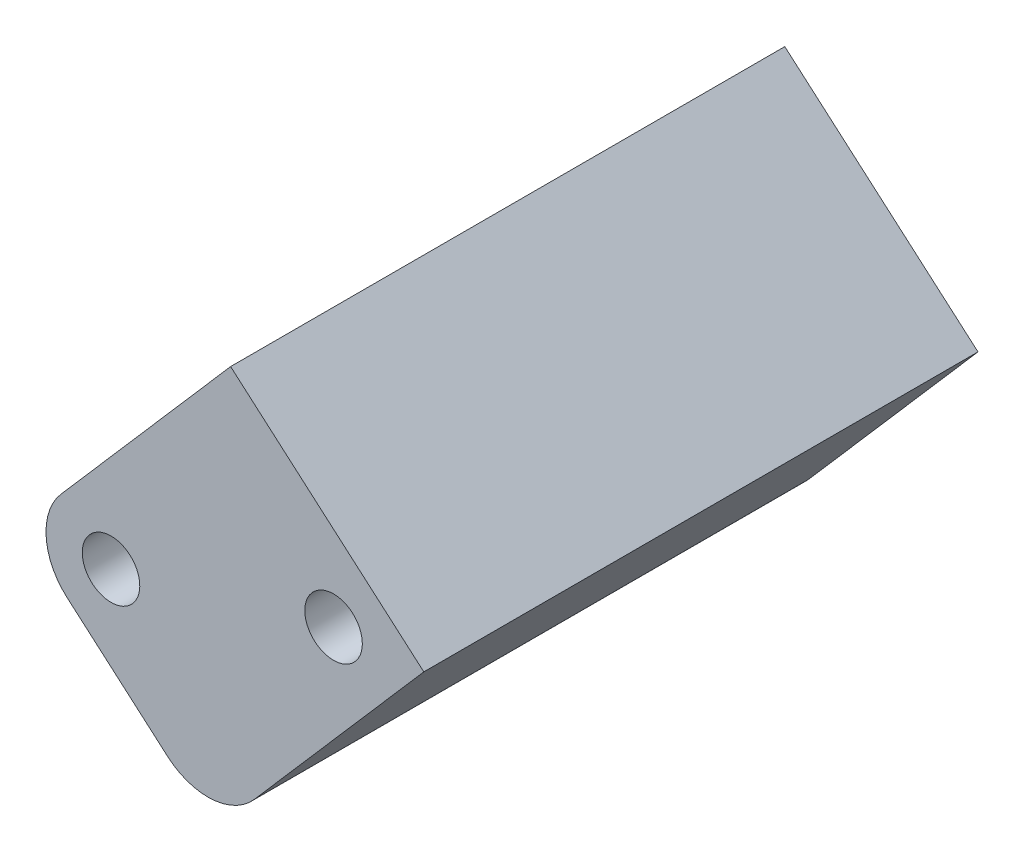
ISO-10303-21;
HEADER;
FILE_DESCRIPTION(('STEP AP214'),'2;1');
FILE_NAME('part.step','',(''),(''),'','','');
FILE_SCHEMA(('AUTOMOTIVE_DESIGN { 1 0 10303 214 1 1 1 1 }'));
ENDSEC;
DATA;
#1=APPLICATION_CONTEXT('core data for automotive mechanical design processes');
#2=APPLICATION_PROTOCOL_DEFINITION('international standard','automotive_design',2000,#1);
#3=PRODUCT_CONTEXT('',#1,'mechanical');
#4=PRODUCT('Part','Part','',(#3));
#5=PRODUCT_RELATED_PRODUCT_CATEGORY('part','',(#4));
#6=PRODUCT_DEFINITION_FORMATION('','',#4);
#7=PRODUCT_DEFINITION_CONTEXT('part definition',#1,'design');
#8=PRODUCT_DEFINITION('design','',#6,#7);
#9=PRODUCT_DEFINITION_SHAPE('','',#8);
#10=(LENGTH_UNIT() NAMED_UNIT(*) SI_UNIT(.MILLI.,.METRE.));
#11=(NAMED_UNIT(*) PLANE_ANGLE_UNIT() SI_UNIT($,.RADIAN.));
#12=(NAMED_UNIT(*) SI_UNIT($,.STERADIAN.) SOLID_ANGLE_UNIT());
#13=UNCERTAINTY_MEASURE_WITH_UNIT(LENGTH_MEASURE(1.E-05),#10,'distance_accuracy_value','');
#14=(GEOMETRIC_REPRESENTATION_CONTEXT(3) GLOBAL_UNCERTAINTY_ASSIGNED_CONTEXT((#13)) GLOBAL_UNIT_ASSIGNED_CONTEXT((#10,
#11,#12)) REPRESENTATION_CONTEXT('',''));
#15=CARTESIAN_POINT('',(0.,0.,0.));
#16=DIRECTION('',(0.,0.,1.));
#17=DIRECTION('',(1.,0.,0.));
#18=AXIS2_PLACEMENT_3D('',#15,#16,#17);
#19=CARTESIAN_POINT('',(-5.06261699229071E-11,1.64313007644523E-11,3.19935692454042));
#20=DIRECTION('',(-1.58417609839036E-11,5.13786431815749E-12,1.));
#21=DIRECTION('',(1.,0.,1.58417609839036E-11));
#22=AXIS2_PLACEMENT_3D('',#19,#20,#21);
#23=PLANE('',#22);
#24=CARTESIAN_POINT('',(-672.686911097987,-85.6457752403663,3.19935691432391));
#25=DIRECTION('',(0.,-5.13786431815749E-12,-1.));
#26=DIRECTION('',(0.,1.,-5.13786431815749E-12));
#27=AXIS2_PLACEMENT_3D('',#24,#25,#26);
#28=CIRCLE('',#27,5.35940000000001);
#29=CARTESIAN_POINT('',(-672.686911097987,-80.2863752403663,3.19935691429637));
#30=VERTEX_POINT('',#29);
#31=EDGE_CURVE('E319',#30,#30,#28,.T.);
#32=ORIENTED_EDGE('',*,*,#31,.F.);
#33=EDGE_LOOP('',(#32));
#34=FACE_BOUND('',#33,.T.);
#35=CARTESIAN_POINT('',(-700.297503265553,-93.2283633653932,3.19935691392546));
#36=DIRECTION('',(0.,-5.13786431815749E-12,-1.));
#37=DIRECTION('',(0.,1.,-5.13786431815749E-12));
#38=AXIS2_PLACEMENT_3D('',#35,#36,#37);
#39=CIRCLE('',#38,5.35940000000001);
#40=CARTESIAN_POINT('',(-700.297503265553,-87.8689633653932,3.19935691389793));
#41=VERTEX_POINT('',#40);
#42=EDGE_CURVE('E303',#41,#41,#39,.T.);
#43=ORIENTED_EDGE('',*,*,#42,.F.);
#44=EDGE_LOOP('',(#43));
#45=FACE_BOUND('',#44,.T.);
#46=DIRECTION('',(-0.655690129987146,-0.755030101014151,-6.50804410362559E-12));
#47=VECTOR('',#46,1.);
#48=CARTESIAN_POINT('',(-706.498736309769,-88.263545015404,3.19935691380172));
#49=LINE('',#48,#47);
#50=CARTESIAN_POINT('',(-685.461524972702,-64.0391025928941,3.19935691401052));
#51=VERTEX_POINT('',#50);
#52=CARTESIAN_POINT('',(-706.498736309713,-88.2635450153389,3.19935691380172));
#53=VERTEX_POINT('',#52);
#54=EDGE_CURVE('E220',#51,#53,#49,.T.);
#55=ORIENTED_EDGE('',*,*,#54,.F.);
#56=DIRECTION('',(-0.755030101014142,0.655690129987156,-1.53298533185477E-11));
#57=VECTOR('',#56,1.);
#58=CARTESIAN_POINT('',(-685.461524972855,-64.0391025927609,3.19935691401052));
#59=LINE('',#58,#57);
#60=CARTESIAN_POINT('',(-661.489319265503,-84.857264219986,3.19935691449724));
#61=VERTEX_POINT('',#60);
#62=EDGE_CURVE('E227',#61,#51,#59,.T.);
#63=ORIENTED_EDGE('',*,*,#62,.F.);
#64=DIRECTION('',(0.655690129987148,0.75503010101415,6.50804410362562E-12));
#65=VECTOR('',#64,1.);
#66=CARTESIAN_POINT('',(-661.48931926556,-84.8572642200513,3.19935691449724));
#67=LINE('',#66,#65);
#68=CARTESIAN_POINT('',(-682.526530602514,-109.081706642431,3.19935691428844));
#69=VERTEX_POINT('',#68);
#70=EDGE_CURVE('E293',#69,#61,#67,.T.);
#71=ORIENTED_EDGE('',*,*,#70,.F.);
#72=CARTESIAN_POINT('',(-688.279859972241,-104.085347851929,3.19935691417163));
#73=DIRECTION('',(-1.58417609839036E-11,5.13786431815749E-12,1.));
#74=DIRECTION('',(1.,0.,1.58417609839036E-11));
#75=AXIS2_PLACEMENT_3D('',#72,#73,#74);
#76=CIRCLE('',#75,7.61999999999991);
#77=CARTESIAN_POINT('',(-693.276218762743,-109.838677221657,3.19935691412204));
#78=VERTEX_POINT('',#77);
#79=EDGE_CURVE('E289',#78,#69,#76,.T.);
#80=ORIENTED_EDGE('',*,*,#79,.F.);
#81=DIRECTION('',(0.755030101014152,-0.655690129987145,1.53298533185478E-11));
#82=VECTOR('',#81,1.);
#83=CARTESIAN_POINT('',(-693.276218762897,-109.838677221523,3.19935691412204));
#84=LINE('',#83,#82);
#85=CARTESIAN_POINT('',(-705.741765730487,-99.0132331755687,3.19935691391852));
#86=VERTEX_POINT('',#85);
#87=EDGE_CURVE('E184',#86,#78,#84,.T.);
#88=ORIENTED_EDGE('',*,*,#87,.F.);
#89=CARTESIAN_POINT('',(-700.745406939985,-93.2599038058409,3.19935691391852));
#90=DIRECTION('',(-1.58417609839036E-11,5.13786431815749E-12,1.));
#91=DIRECTION('',(1.,0.,1.58417609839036E-11));
#92=AXIS2_PLACEMENT_3D('',#89,#90,#91);
#93=CIRCLE('',#92,7.61999999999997);
#94=EDGE_CURVE('E60',#53,#86,#93,.T.);
#95=ORIENTED_EDGE('',*,*,#94,.F.);
#96=EDGE_LOOP('',(#55,#63,#71,#80,#88,#95));
#97=FACE_BOUND('',#96,.T.);
#98=ADVANCED_FACE('F168',(#34,#45,#97),#23,.F.);
#99=CARTESIAN_POINT('',(-706.498736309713,-88.2635450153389,-10.033));
#100=DIRECTION('',(0.755030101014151,-0.655690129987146,0.));
#101=DIRECTION('',(0.655690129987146,0.755030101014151,0.));
#102=AXIS2_PLACEMENT_3D('',#99,#100,#101);
#103=PLANE('',#102);
#104=DIRECTION('',(0.,0.,1.));
#105=VECTOR('',#104,1.);
#106=CARTESIAN_POINT('',(-685.461524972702,-64.039102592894,-10.033));
#107=LINE('',#106,#105);
#108=CARTESIAN_POINT('',(-685.461524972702,-64.039102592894,71.9582));
#109=VERTEX_POINT('',#108);
#110=EDGE_CURVE('E177',#51,#109,#107,.T.);
#111=ORIENTED_EDGE('',*,*,#110,.F.);
#112=ORIENTED_EDGE('',*,*,#54,.T.);
#113=DIRECTION('',(0.,0.,1.));
#114=VECTOR('',#113,1.);
#115=CARTESIAN_POINT('',(-706.498736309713,-88.2635450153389,-10.033));
#116=LINE('',#115,#114);
#117=CARTESIAN_POINT('',(-706.498736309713,-88.2635450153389,71.9582));
#118=VERTEX_POINT('',#117);
#119=EDGE_CURVE('E191',#53,#118,#116,.T.);
#120=ORIENTED_EDGE('',*,*,#119,.T.);
#121=DIRECTION('',(0.655690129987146,0.755030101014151,0.));
#122=VECTOR('',#121,1.);
#123=CARTESIAN_POINT('',(-706.498736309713,-88.2635450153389,71.9582));
#124=LINE('',#123,#122);
#125=EDGE_CURVE('E226',#118,#109,#124,.T.);
#126=ORIENTED_EDGE('',*,*,#125,.T.);
#127=EDGE_LOOP('',(#111,#112,#120,#126));
#128=FACE_BOUND('',#127,.T.);
#129=ADVANCED_FACE('F170',(#128),#103,.F.);
#130=CARTESIAN_POINT('',(-685.461524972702,-64.039102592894,-10.033));
#131=DIRECTION('',(-0.655690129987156,-0.755030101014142,0.));
#132=DIRECTION('',(0.755030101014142,-0.655690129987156,0.));
#133=AXIS2_PLACEMENT_3D('',#130,#131,#132);
#134=PLANE('',#133);
#135=DIRECTION('',(0.,0.,1.));
#136=VECTOR('',#135,1.);
#137=CARTESIAN_POINT('',(-661.489319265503,-84.857264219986,-10.033));
#138=LINE('',#137,#136);
#139=CARTESIAN_POINT('',(-661.489319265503,-84.857264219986,71.9582));
#140=VERTEX_POINT('',#139);
#141=EDGE_CURVE('E250',#61,#140,#138,.T.);
#142=ORIENTED_EDGE('',*,*,#141,.F.);
#143=ORIENTED_EDGE('',*,*,#62,.T.);
#144=ORIENTED_EDGE('',*,*,#110,.T.);
#145=DIRECTION('',(0.755030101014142,-0.655690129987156,0.));
#146=VECTOR('',#145,1.);
#147=CARTESIAN_POINT('',(-685.461524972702,-64.039102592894,71.9582));
#148=LINE('',#147,#146);
#149=EDGE_CURVE('E259',#109,#140,#148,.T.);
#150=ORIENTED_EDGE('',*,*,#149,.T.);
#151=EDGE_LOOP('',(#142,#143,#144,#150));
#152=FACE_BOUND('',#151,.T.);
#153=ADVANCED_FACE('F258',(#152),#134,.F.);
#154=CARTESIAN_POINT('',(-661.489319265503,-84.857264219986,-10.033));
#155=DIRECTION('',(-0.755030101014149,0.655690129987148,0.));
#156=DIRECTION('',(-0.655690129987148,-0.75503010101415,0.));
#157=AXIS2_PLACEMENT_3D('',#154,#155,#156);
#158=PLANE('',#157);
#159=DIRECTION('',(0.,0.,1.));
#160=VECTOR('',#159,1.);
#161=CARTESIAN_POINT('',(-682.526530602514,-109.081706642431,-10.033));
#162=LINE('',#161,#160);
#163=CARTESIAN_POINT('',(-682.526530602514,-109.081706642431,71.9582));
#164=VERTEX_POINT('',#163);
#165=EDGE_CURVE('E247',#69,#164,#162,.T.);
#166=ORIENTED_EDGE('',*,*,#165,.F.);
#167=ORIENTED_EDGE('',*,*,#70,.T.);
#168=ORIENTED_EDGE('',*,*,#141,.T.);
#169=DIRECTION('',(-0.655690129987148,-0.75503010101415,0.));
#170=VECTOR('',#169,1.);
#171=CARTESIAN_POINT('',(-661.489319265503,-84.857264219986,71.9582));
#172=LINE('',#171,#170);
#173=EDGE_CURVE('E265',#140,#164,#172,.T.);
#174=ORIENTED_EDGE('',*,*,#173,.T.);
#175=EDGE_LOOP('',(#166,#167,#168,#174));
#176=FACE_BOUND('',#175,.T.);
#177=ADVANCED_FACE('F292',(#176),#158,.F.);
#178=CARTESIAN_POINT('',(-688.279859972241,-104.085347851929,-10.033));
#179=DIRECTION('',(0.,0.,1.));
#180=DIRECTION('',(1.,0.,0.));
#181=AXIS2_PLACEMENT_3D('',#178,#179,#180);
#182=CYLINDRICAL_SURFACE('',#181,7.61999999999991);
#183=DIRECTION('',(0.,0.,1.));
#184=VECTOR('',#183,1.);
#185=CARTESIAN_POINT('',(-693.276218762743,-109.838677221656,-10.033));
#186=LINE('',#185,#184);
#187=CARTESIAN_POINT('',(-693.276218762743,-109.838677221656,71.9582));
#188=VERTEX_POINT('',#187);
#189=EDGE_CURVE('E239',#78,#188,#186,.T.);
#190=ORIENTED_EDGE('',*,*,#189,.F.);
#191=ORIENTED_EDGE('',*,*,#79,.T.);
#192=ORIENTED_EDGE('',*,*,#165,.T.);
#193=CARTESIAN_POINT('',(-688.279859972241,-104.085347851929,71.9582));
#194=DIRECTION('',(0.,0.,-1.));
#195=DIRECTION('',(-1.,0.,0.));
#196=AXIS2_PLACEMENT_3D('',#193,#194,#195);
#197=CIRCLE('',#196,7.61999999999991);
#198=EDGE_CURVE('E275',#164,#188,#197,.T.);
#199=ORIENTED_EDGE('',*,*,#198,.T.);
#200=EDGE_LOOP('',(#190,#191,#192,#199));
#201=FACE_BOUND('',#200,.T.);
#202=ADVANCED_FACE('F286',(#201),#182,.T.);
#203=CARTESIAN_POINT('',(-693.276218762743,-109.838677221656,-10.033));
#204=DIRECTION('',(0.655690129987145,0.755030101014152,0.));
#205=DIRECTION('',(-0.755030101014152,0.655690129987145,0.));
#206=AXIS2_PLACEMENT_3D('',#203,#204,#205);
#207=PLANE('',#206);
#208=DIRECTION('',(0.,0.,1.));
#209=VECTOR('',#208,1.);
#210=CARTESIAN_POINT('',(-705.741765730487,-99.0132331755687,-10.033));
#211=LINE('',#210,#209);
#212=CARTESIAN_POINT('',(-705.741765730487,-99.0132331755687,71.9582));
#213=VERTEX_POINT('',#212);
#214=EDGE_CURVE('E234',#86,#213,#211,.T.);
#215=ORIENTED_EDGE('',*,*,#214,.F.);
#216=ORIENTED_EDGE('',*,*,#87,.T.);
#217=ORIENTED_EDGE('',*,*,#189,.T.);
#218=DIRECTION('',(-0.755030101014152,0.655690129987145,0.));
#219=VECTOR('',#218,1.);
#220=CARTESIAN_POINT('',(-693.276218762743,-109.838677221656,71.9582));
#221=LINE('',#220,#219);
#222=EDGE_CURVE('E241',#188,#213,#221,.T.);
#223=ORIENTED_EDGE('',*,*,#222,.T.);
#224=EDGE_LOOP('',(#215,#216,#217,#223));
#225=FACE_BOUND('',#224,.T.);
#226=ADVANCED_FACE('F283',(#225),#207,.F.);
#227=CARTESIAN_POINT('',(-700.745406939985,-93.2599038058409,-10.033));
#228=DIRECTION('',(0.,0.,1.));
#229=DIRECTION('',(1.,0.,0.));
#230=AXIS2_PLACEMENT_3D('',#227,#228,#229);
#231=CYLINDRICAL_SURFACE('',#230,7.61999999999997);
#232=ORIENTED_EDGE('',*,*,#119,.F.);
#233=ORIENTED_EDGE('',*,*,#94,.T.);
#234=ORIENTED_EDGE('',*,*,#214,.T.);
#235=CARTESIAN_POINT('',(-700.745406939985,-93.2599038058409,71.9582));
#236=DIRECTION('',(0.,0.,-1.));
#237=DIRECTION('',(-1.,0.,0.));
#238=AXIS2_PLACEMENT_3D('',#235,#236,#237);
#239=CIRCLE('',#238,7.61999999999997);
#240=EDGE_CURVE('E231',#213,#118,#239,.T.);
#241=ORIENTED_EDGE('',*,*,#240,.T.);
#242=EDGE_LOOP('',(#232,#233,#234,#241));
#243=FACE_BOUND('',#242,.T.);
#244=ADVANCED_FACE('F229',(#243),#231,.T.);
#245=CARTESIAN_POINT('',(-688.279859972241,-104.085347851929,71.9582));
#246=DIRECTION('',(0.,0.,-1.));
#247=DIRECTION('',(-1.,0.,0.));
#248=AXIS2_PLACEMENT_3D('',#245,#246,#247);
#249=PLANE('',#248);
#250=CARTESIAN_POINT('',(-672.686911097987,-85.6457752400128,71.9582000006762));
#251=DIRECTION('',(0.,-5.13786431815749E-12,-1.));
#252=DIRECTION('',(0.,1.,-5.13786431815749E-12));
#253=AXIS2_PLACEMENT_3D('',#250,#251,#252);
#254=CIRCLE('',#253,3.56869999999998);
#255=CARTESIAN_POINT('',(-672.686911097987,-82.0770752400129,71.9582000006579));
#256=VERTEX_POINT('',#255);
#257=EDGE_CURVE('E331',#256,#256,#254,.T.);
#258=ORIENTED_EDGE('',*,*,#257,.T.);
#259=EDGE_LOOP('',(#258));
#260=FACE_BOUND('',#259,.T.);
#261=CARTESIAN_POINT('',(-700.297503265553,-93.22836336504,71.9582000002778));
#262=DIRECTION('',(0.,-5.13786431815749E-12,-1.));
#263=DIRECTION('',(0.,1.,-5.13786431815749E-12));
#264=AXIS2_PLACEMENT_3D('',#261,#262,#263);
#265=CIRCLE('',#264,3.56869999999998);
#266=CARTESIAN_POINT('',(-700.297503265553,-89.65966336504,71.9582000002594));
#267=VERTEX_POINT('',#266);
#268=EDGE_CURVE('E315',#267,#267,#265,.T.);
#269=ORIENTED_EDGE('',*,*,#268,.T.);
#270=EDGE_LOOP('',(#269));
#271=FACE_BOUND('',#270,.T.);
#272=ORIENTED_EDGE('',*,*,#125,.F.);
#273=ORIENTED_EDGE('',*,*,#240,.F.);
#274=ORIENTED_EDGE('',*,*,#222,.F.);
#275=ORIENTED_EDGE('',*,*,#198,.F.);
#276=ORIENTED_EDGE('',*,*,#173,.F.);
#277=ORIENTED_EDGE('',*,*,#149,.F.);
#278=EDGE_LOOP('',(#272,#273,#274,#275,#276,#277));
#279=FACE_BOUND('',#278,.T.);
#280=ADVANCED_FACE('F262',(#260,#271,#279),#249,.F.);
#281=CARTESIAN_POINT('',(-700.297503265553,-93.2283633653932,3.19935691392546));
#282=DIRECTION('',(0.,-5.13786431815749E-12,-1.));
#283=DIRECTION('',(0.,1.,-5.13786431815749E-12));
#284=AXIS2_PLACEMENT_3D('',#281,#282,#283);
#285=CYLINDRICAL_SURFACE('',#284,5.35940000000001);
#286=CARTESIAN_POINT('',(-700.297503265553,-93.2283633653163,18.1853569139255));
#287=DIRECTION('',(0.,-5.13786431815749E-12,-1.));
#288=DIRECTION('',(0.,1.,-5.13786431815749E-12));
#289=AXIS2_PLACEMENT_3D('',#286,#287,#288);
#290=CIRCLE('',#289,5.35940000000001);
#291=CARTESIAN_POINT('',(-700.297503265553,-87.8689633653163,18.1853569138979));
#292=VERTEX_POINT('',#291);
#293=EDGE_CURVE('E307',#292,#292,#290,.T.);
#294=ORIENTED_EDGE('',*,*,#293,.F.);
#295=EDGE_LOOP('',(#294));
#296=FACE_BOUND('',#295,.T.);
#297=ORIENTED_EDGE('',*,*,#42,.T.);
#298=EDGE_LOOP('',(#297));
#299=FACE_BOUND('',#298,.T.);
#300=ADVANCED_FACE('F363',(#296,#299),#285,.F.);
#301=CARTESIAN_POINT('',(-696.728803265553,-93.2283633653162,18.1853569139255));
#302=DIRECTION('',(0.,5.13786431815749E-12,1.));
#303=DIRECTION('',(0.,-1.,5.13786431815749E-12));
#304=AXIS2_PLACEMENT_3D('',#301,#302,#303);
#305=PLANE('',#304);
#306=CARTESIAN_POINT('',(-700.297503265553,-93.2283633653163,18.1853569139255));
#307=DIRECTION('',(0.,-5.13786431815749E-12,-1.));
#308=DIRECTION('',(0.,1.,-5.13786431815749E-12));
#309=AXIS2_PLACEMENT_3D('',#306,#307,#308);
#310=CIRCLE('',#309,3.56869999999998);
#311=CARTESIAN_POINT('',(-700.297503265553,-89.6596633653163,18.1853569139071));
#312=VERTEX_POINT('',#311);
#313=EDGE_CURVE('E311',#312,#312,#310,.T.);
#314=ORIENTED_EDGE('',*,*,#313,.F.);
#315=EDGE_LOOP('',(#314));
#316=FACE_BOUND('',#315,.T.);
#317=ORIENTED_EDGE('',*,*,#293,.T.);
#318=EDGE_LOOP('',(#317));
#319=FACE_BOUND('',#318,.T.);
#320=ADVANCED_FACE('F365',(#316,#319),#305,.F.);
#321=CARTESIAN_POINT('',(-700.297503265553,-93.2283633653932,3.19935691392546));
#322=DIRECTION('',(0.,-5.13786431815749E-12,-1.));
#323=DIRECTION('',(0.,1.,-5.13786431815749E-12));
#324=AXIS2_PLACEMENT_3D('',#321,#322,#323);
#325=CYLINDRICAL_SURFACE('',#324,3.56869999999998);
#326=ORIENTED_EDGE('',*,*,#268,.F.);
#327=EDGE_LOOP('',(#326));
#328=FACE_BOUND('',#327,.T.);
#329=ORIENTED_EDGE('',*,*,#313,.T.);
#330=EDGE_LOOP('',(#329));
#331=FACE_BOUND('',#330,.T.);
#332=ADVANCED_FACE('F354',(#328,#331),#325,.F.);
#333=CARTESIAN_POINT('',(-672.686911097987,-85.6457752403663,3.19935691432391));
#334=DIRECTION('',(0.,-5.13786431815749E-12,-1.));
#335=DIRECTION('',(0.,1.,-5.13786431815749E-12));
#336=AXIS2_PLACEMENT_3D('',#333,#334,#335);
#337=CYLINDRICAL_SURFACE('',#336,5.35940000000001);
#338=CARTESIAN_POINT('',(-672.686911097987,-85.6457752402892,18.1853569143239));
#339=DIRECTION('',(0.,-5.13786431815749E-12,-1.));
#340=DIRECTION('',(0.,1.,-5.13786431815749E-12));
#341=AXIS2_PLACEMENT_3D('',#338,#339,#340);
#342=CIRCLE('',#341,5.35940000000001);
#343=CARTESIAN_POINT('',(-672.686911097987,-80.2863752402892,18.1853569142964));
#344=VERTEX_POINT('',#343);
#345=EDGE_CURVE('E323',#344,#344,#342,.T.);
#346=ORIENTED_EDGE('',*,*,#345,.F.);
#347=EDGE_LOOP('',(#346));
#348=FACE_BOUND('',#347,.T.);
#349=ORIENTED_EDGE('',*,*,#31,.T.);
#350=EDGE_LOOP('',(#349));
#351=FACE_BOUND('',#350,.T.);
#352=ADVANCED_FACE('F348',(#348,#351),#337,.F.);
#353=CARTESIAN_POINT('',(-669.118211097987,-85.6457752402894,18.1853569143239));
#354=DIRECTION('',(0.,5.13786431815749E-12,1.));
#355=DIRECTION('',(0.,-1.,5.13786431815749E-12));
#356=AXIS2_PLACEMENT_3D('',#353,#354,#355);
#357=PLANE('',#356);
#358=CARTESIAN_POINT('',(-672.686911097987,-85.6457752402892,18.1853569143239));
#359=DIRECTION('',(0.,-5.13786431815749E-12,-1.));
#360=DIRECTION('',(0.,1.,-5.13786431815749E-12));
#361=AXIS2_PLACEMENT_3D('',#358,#359,#360);
#362=CIRCLE('',#361,3.56869999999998);
#363=CARTESIAN_POINT('',(-672.686911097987,-82.0770752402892,18.1853569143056));
#364=VERTEX_POINT('',#363);
#365=EDGE_CURVE('E327',#364,#364,#362,.T.);
#366=ORIENTED_EDGE('',*,*,#365,.F.);
#367=EDGE_LOOP('',(#366));
#368=FACE_BOUND('',#367,.T.);
#369=ORIENTED_EDGE('',*,*,#345,.T.);
#370=EDGE_LOOP('',(#369));
#371=FACE_BOUND('',#370,.T.);
#372=ADVANCED_FACE('F342',(#368,#371),#357,.F.);
#373=CARTESIAN_POINT('',(-672.686911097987,-85.6457752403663,3.19935691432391));
#374=DIRECTION('',(0.,-5.13786431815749E-12,-1.));
#375=DIRECTION('',(0.,1.,-5.13786431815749E-12));
#376=AXIS2_PLACEMENT_3D('',#373,#374,#375);
#377=CYLINDRICAL_SURFACE('',#376,3.56869999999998);
#378=ORIENTED_EDGE('',*,*,#257,.F.);
#379=EDGE_LOOP('',(#378));
#380=FACE_BOUND('',#379,.T.);
#381=ORIENTED_EDGE('',*,*,#365,.T.);
#382=EDGE_LOOP('',(#381));
#383=FACE_BOUND('',#382,.T.);
#384=ADVANCED_FACE('F339',(#380,#383),#377,.F.);
#385=CLOSED_SHELL('',(#98,#129,#153,#177,#202,#226,#244,#280,#300,#320,#332,#352,#372,#384));
#386=MANIFOLD_SOLID_BREP('B7',#385);
#387=ADVANCED_BREP_SHAPE_REPRESENTATION('',(#18,#386),#14);
#388=SHAPE_DEFINITION_REPRESENTATION(#9,#387);
ENDSEC;
END-ISO-10303-21;
